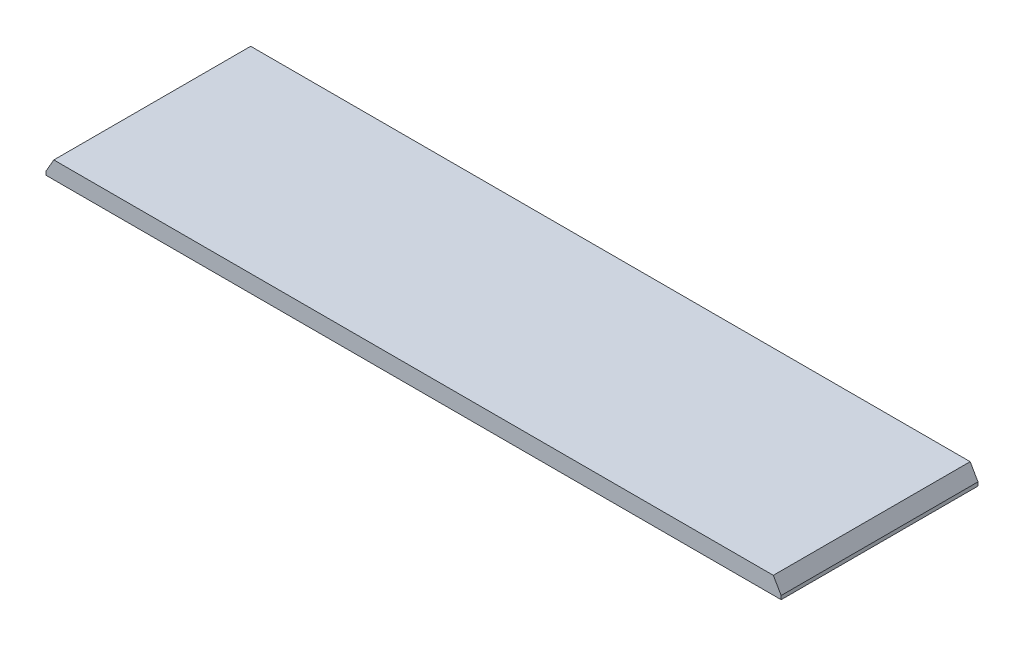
ISO-10303-21;
HEADER;
FILE_DESCRIPTION(('STEP AP214'),'2;1');
FILE_NAME('part.step','',(''),(''),'','','');
FILE_SCHEMA(('AUTOMOTIVE_DESIGN { 1 0 10303 214 1 1 1 1 }'));
ENDSEC;
DATA;
#1=APPLICATION_CONTEXT('core data for automotive mechanical design processes');
#2=APPLICATION_PROTOCOL_DEFINITION('international standard','automotive_design',2000,#1);
#3=PRODUCT_CONTEXT('',#1,'mechanical');
#4=PRODUCT('Part','Part','',(#3));
#5=PRODUCT_RELATED_PRODUCT_CATEGORY('part','',(#4));
#6=PRODUCT_DEFINITION_FORMATION('','',#4);
#7=PRODUCT_DEFINITION_CONTEXT('part definition',#1,'design');
#8=PRODUCT_DEFINITION('design','',#6,#7);
#9=PRODUCT_DEFINITION_SHAPE('','',#8);
#10=(LENGTH_UNIT() NAMED_UNIT(*) SI_UNIT(.MILLI.,.METRE.));
#11=(NAMED_UNIT(*) PLANE_ANGLE_UNIT() SI_UNIT($,.RADIAN.));
#12=(NAMED_UNIT(*) SI_UNIT($,.STERADIAN.) SOLID_ANGLE_UNIT());
#13=UNCERTAINTY_MEASURE_WITH_UNIT(LENGTH_MEASURE(1.E-05),#10,'distance_accuracy_value','');
#14=(GEOMETRIC_REPRESENTATION_CONTEXT(3) GLOBAL_UNCERTAINTY_ASSIGNED_CONTEXT((#13)) GLOBAL_UNIT_ASSIGNED_CONTEXT((#10,
#11,#12)) REPRESENTATION_CONTEXT('',''));
#15=CARTESIAN_POINT('',(0.,0.,0.));
#16=DIRECTION('',(0.,0.,1.));
#17=DIRECTION('',(1.,0.,0.));
#18=AXIS2_PLACEMENT_3D('',#15,#16,#17);
#19=CARTESIAN_POINT('',(541.5415,25.4,145.));
#20=DIRECTION('',(-1.,0.,0.));
#21=DIRECTION('',(0.,0.,1.));
#22=AXIS2_PLACEMENT_3D('',#19,#20,#21);
#23=PLANE('',#22);
#24=DIRECTION('',(0.,-1.,0.));
#25=VECTOR('',#24,1.);
#26=CARTESIAN_POINT('',(541.5415,25.4,-145.));
#27=LINE('',#26,#25);
#28=CARTESIAN_POINT('',(541.5415,5.39999999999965,-145.));
#29=VERTEX_POINT('',#28);
#30=CARTESIAN_POINT('',(541.5415,0.,-145.));
#31=VERTEX_POINT('',#30);
#32=EDGE_CURVE('E96',#29,#31,#27,.T.);
#33=ORIENTED_EDGE('',*,*,#32,.F.);
#34=DIRECTION('',(0.,0.,1.));
#35=VECTOR('',#34,1.);
#36=CARTESIAN_POINT('',(541.5415,5.39999999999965,145.));
#37=LINE('',#36,#35);
#38=CARTESIAN_POINT('',(541.5415,5.39999999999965,145.));
#39=VERTEX_POINT('',#38);
#40=EDGE_CURVE('E11',#29,#39,#37,.T.);
#41=ORIENTED_EDGE('',*,*,#40,.T.);
#42=DIRECTION('',(0.,-1.,0.));
#43=VECTOR('',#42,1.);
#44=CARTESIAN_POINT('',(541.5415,25.4,145.));
#45=LINE('',#44,#43);
#46=CARTESIAN_POINT('',(541.5415,0.,145.));
#47=VERTEX_POINT('',#46);
#48=EDGE_CURVE('E119',#39,#47,#45,.T.);
#49=ORIENTED_EDGE('',*,*,#48,.T.);
#50=DIRECTION('',(0.,0.,-1.));
#51=VECTOR('',#50,1.);
#52=CARTESIAN_POINT('',(541.5415,0.,145.));
#53=LINE('',#52,#51);
#54=EDGE_CURVE('E112',#47,#31,#53,.T.);
#55=ORIENTED_EDGE('',*,*,#54,.T.);
#56=EDGE_LOOP('',(#33,#41,#49,#55));
#57=FACE_BOUND('',#56,.T.);
#58=ADVANCED_FACE('F44',(#57),#23,.F.);
#59=CARTESIAN_POINT('',(541.5415,25.4,-145.));
#60=DIRECTION('',(0.,0.,1.));
#61=DIRECTION('',(1.,0.,0.));
#62=AXIS2_PLACEMENT_3D('',#59,#60,#61);
#63=PLANE('',#62);
#64=DIRECTION('',(0.,-1.,0.));
#65=VECTOR('',#64,1.);
#66=CARTESIAN_POINT('',(-541.5415,25.4,-145.));
#67=LINE('',#66,#65);
#68=CARTESIAN_POINT('',(-541.5415,5.39999999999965,-145.));
#69=VERTEX_POINT('',#68);
#70=CARTESIAN_POINT('',(-541.5415,0.,-145.));
#71=VERTEX_POINT('',#70);
#72=EDGE_CURVE('E108',#69,#71,#67,.T.);
#73=ORIENTED_EDGE('',*,*,#72,.F.);
#74=DIRECTION('',(0.5,0.866025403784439,0.));
#75=VECTOR('',#74,1.);
#76=CARTESIAN_POINT('',(-529.994494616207,25.4,-145.));
#77=LINE('',#76,#75);
#78=CARTESIAN_POINT('',(-529.994494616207,25.4,-145.));
#79=VERTEX_POINT('',#78);
#80=EDGE_CURVE('E54',#69,#79,#77,.T.);
#81=ORIENTED_EDGE('',*,*,#80,.T.);
#82=DIRECTION('',(-1.,0.,0.));
#83=VECTOR('',#82,1.);
#84=CARTESIAN_POINT('',(541.5415,25.4,-145.));
#85=LINE('',#84,#83);
#86=CARTESIAN_POINT('',(529.994494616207,25.4,-145.));
#87=VERTEX_POINT('',#86);
#88=EDGE_CURVE('E131',#87,#79,#85,.T.);
#89=ORIENTED_EDGE('',*,*,#88,.F.);
#90=DIRECTION('',(0.5,-0.866025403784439,0.));
#91=VECTOR('',#90,1.);
#92=CARTESIAN_POINT('',(529.994494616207,25.4,-145.));
#93=LINE('',#92,#91);
#94=EDGE_CURVE('E65',#87,#29,#93,.T.);
#95=ORIENTED_EDGE('',*,*,#94,.T.);
#96=ORIENTED_EDGE('',*,*,#32,.T.);
#97=DIRECTION('',(-1.,0.,0.));
#98=VECTOR('',#97,1.);
#99=CARTESIAN_POINT('',(541.5415,0.,-145.));
#100=LINE('',#99,#98);
#101=EDGE_CURVE('E103',#31,#71,#100,.T.);
#102=ORIENTED_EDGE('',*,*,#101,.T.);
#103=EDGE_LOOP('',(#73,#81,#89,#95,#96,#102));
#104=FACE_BOUND('',#103,.T.);
#105=ADVANCED_FACE('F99',(#104),#63,.F.);
#106=CARTESIAN_POINT('',(-541.5415,25.4,145.));
#107=DIRECTION('',(1.,0.,0.));
#108=DIRECTION('',(0.,0.,-1.));
#109=AXIS2_PLACEMENT_3D('',#106,#107,#108);
#110=PLANE('',#109);
#111=DIRECTION('',(0.,-1.,0.));
#112=VECTOR('',#111,1.);
#113=CARTESIAN_POINT('',(-541.5415,25.4,145.));
#114=LINE('',#113,#112);
#115=CARTESIAN_POINT('',(-541.5415,5.39999999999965,145.));
#116=VERTEX_POINT('',#115);
#117=CARTESIAN_POINT('',(-541.5415,0.,145.));
#118=VERTEX_POINT('',#117);
#119=EDGE_CURVE('E136',#116,#118,#114,.T.);
#120=ORIENTED_EDGE('',*,*,#119,.F.);
#121=DIRECTION('',(0.,0.,-1.));
#122=VECTOR('',#121,1.);
#123=CARTESIAN_POINT('',(-541.5415,5.39999999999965,-145.));
#124=LINE('',#123,#122);
#125=EDGE_CURVE('E68',#116,#69,#124,.T.);
#126=ORIENTED_EDGE('',*,*,#125,.T.);
#127=ORIENTED_EDGE('',*,*,#72,.T.);
#128=DIRECTION('',(0.,0.,1.));
#129=VECTOR('',#128,1.);
#130=CARTESIAN_POINT('',(-541.5415,0.,145.));
#131=LINE('',#130,#129);
#132=EDGE_CURVE('E116',#71,#118,#131,.T.);
#133=ORIENTED_EDGE('',*,*,#132,.T.);
#134=EDGE_LOOP('',(#120,#126,#127,#133));
#135=FACE_BOUND('',#134,.T.);
#136=ADVANCED_FACE('F173',(#135),#110,.F.);
#137=CARTESIAN_POINT('',(541.5415,25.4,145.));
#138=DIRECTION('',(0.,0.,-1.));
#139=DIRECTION('',(-1.,0.,0.));
#140=AXIS2_PLACEMENT_3D('',#137,#138,#139);
#141=PLANE('',#140);
#142=DIRECTION('',(1.,0.,0.));
#143=VECTOR('',#142,1.);
#144=CARTESIAN_POINT('',(541.5415,25.4,145.));
#145=LINE('',#144,#143);
#146=CARTESIAN_POINT('',(-529.994494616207,25.4,145.));
#147=VERTEX_POINT('',#146);
#148=CARTESIAN_POINT('',(529.994494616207,25.4,145.));
#149=VERTEX_POINT('',#148);
#150=EDGE_CURVE('E127',#147,#149,#145,.T.);
#151=ORIENTED_EDGE('',*,*,#150,.F.);
#152=DIRECTION('',(-0.5,-0.866025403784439,0.));
#153=VECTOR('',#152,1.);
#154=CARTESIAN_POINT('',(-529.994494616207,25.4,145.));
#155=LINE('',#154,#153);
#156=EDGE_CURVE('E155',#147,#116,#155,.T.);
#157=ORIENTED_EDGE('',*,*,#156,.T.);
#158=ORIENTED_EDGE('',*,*,#119,.T.);
#159=DIRECTION('',(1.,0.,0.));
#160=VECTOR('',#159,1.);
#161=CARTESIAN_POINT('',(541.5415,0.,145.));
#162=LINE('',#161,#160);
#163=EDGE_CURVE('E132',#118,#47,#162,.T.);
#164=ORIENTED_EDGE('',*,*,#163,.T.);
#165=ORIENTED_EDGE('',*,*,#48,.F.);
#166=DIRECTION('',(-0.5,0.866025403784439,0.));
#167=VECTOR('',#166,1.);
#168=CARTESIAN_POINT('',(529.994494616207,25.4,145.));
#169=LINE('',#168,#167);
#170=EDGE_CURVE('E146',#39,#149,#169,.T.);
#171=ORIENTED_EDGE('',*,*,#170,.T.);
#172=EDGE_LOOP('',(#151,#157,#158,#164,#165,#171));
#173=FACE_BOUND('',#172,.T.);
#174=ADVANCED_FACE('F175',(#173),#141,.F.);
#175=CARTESIAN_POINT('',(0.,25.4,0.));
#176=DIRECTION('',(0.,1.,0.));
#177=DIRECTION('',(0.,0.,1.));
#178=AXIS2_PLACEMENT_3D('',#175,#176,#177);
#179=PLANE('',#178);
#180=ORIENTED_EDGE('',*,*,#88,.T.);
#181=DIRECTION('',(0.,0.,1.));
#182=VECTOR('',#181,1.);
#183=CARTESIAN_POINT('',(-529.994494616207,25.4,145.));
#184=LINE('',#183,#182);
#185=EDGE_CURVE('E143',#79,#147,#184,.T.);
#186=ORIENTED_EDGE('',*,*,#185,.T.);
#187=ORIENTED_EDGE('',*,*,#150,.T.);
#188=DIRECTION('',(0.,0.,-1.));
#189=VECTOR('',#188,1.);
#190=CARTESIAN_POINT('',(529.994494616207,25.4,-145.));
#191=LINE('',#190,#189);
#192=EDGE_CURVE('E110',#149,#87,#191,.T.);
#193=ORIENTED_EDGE('',*,*,#192,.T.);
#194=EDGE_LOOP('',(#180,#186,#187,#193));
#195=FACE_BOUND('',#194,.T.);
#196=ADVANCED_FACE('F164',(#195),#179,.T.);
#197=CARTESIAN_POINT('',(0.,0.,0.));
#198=DIRECTION('',(0.,1.,0.));
#199=DIRECTION('',(0.,0.,1.));
#200=AXIS2_PLACEMENT_3D('',#197,#198,#199);
#201=PLANE('',#200);
#202=ORIENTED_EDGE('',*,*,#54,.F.);
#203=ORIENTED_EDGE('',*,*,#163,.F.);
#204=ORIENTED_EDGE('',*,*,#132,.F.);
#205=ORIENTED_EDGE('',*,*,#101,.F.);
#206=EDGE_LOOP('',(#202,#203,#204,#205));
#207=FACE_BOUND('',#206,.T.);
#208=ADVANCED_FACE('F115',(#207),#201,.F.);
#209=CARTESIAN_POINT('',(-529.994494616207,25.4,0.));
#210=DIRECTION('',(-0.866025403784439,0.5,0.));
#211=DIRECTION('',(0.,0.,-1.));
#212=AXIS2_PLACEMENT_3D('',#209,#210,#211);
#213=PLANE('',#212);
#214=ORIENTED_EDGE('',*,*,#80,.F.);
#215=ORIENTED_EDGE('',*,*,#125,.F.);
#216=ORIENTED_EDGE('',*,*,#156,.F.);
#217=ORIENTED_EDGE('',*,*,#185,.F.);
#218=EDGE_LOOP('',(#214,#215,#216,#217));
#219=FACE_BOUND('',#218,.T.);
#220=ADVANCED_FACE('F167',(#219),#213,.T.);
#221=CARTESIAN_POINT('',(529.994494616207,25.4,0.));
#222=DIRECTION('',(0.866025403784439,0.5,0.));
#223=DIRECTION('',(0.,0.,1.));
#224=AXIS2_PLACEMENT_3D('',#221,#222,#223);
#225=PLANE('',#224);
#226=ORIENTED_EDGE('',*,*,#170,.F.);
#227=ORIENTED_EDGE('',*,*,#40,.F.);
#228=ORIENTED_EDGE('',*,*,#94,.F.);
#229=ORIENTED_EDGE('',*,*,#192,.F.);
#230=EDGE_LOOP('',(#226,#227,#228,#229));
#231=FACE_BOUND('',#230,.T.);
#232=ADVANCED_FACE('F48',(#231),#225,.T.);
#233=CLOSED_SHELL('',(#58,#105,#136,#174,#196,#208,#220,#232));
#234=MANIFOLD_SOLID_BREP('B2',#233);
#235=ADVANCED_BREP_SHAPE_REPRESENTATION('',(#18,#234),#14);
#236=SHAPE_DEFINITION_REPRESENTATION(#9,#235);
ENDSEC;
END-ISO-10303-21;
